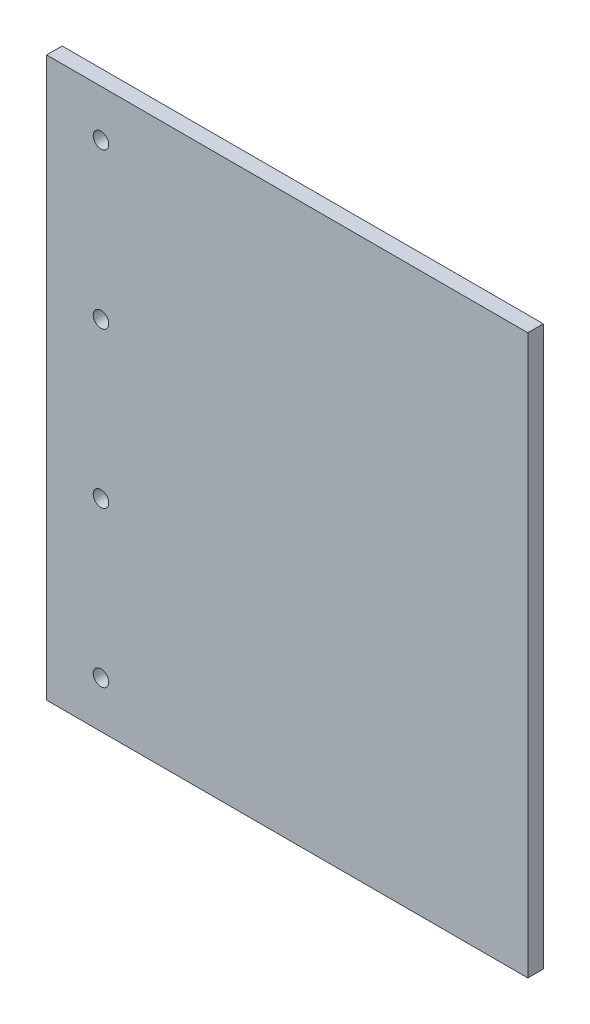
ISO-10303-21;
HEADER;
FILE_DESCRIPTION(('STEP AP214'),'2;1');
FILE_NAME('part.step','',(''),(''),'','','');
FILE_SCHEMA(('AUTOMOTIVE_DESIGN { 1 0 10303 214 1 1 1 1 }'));
ENDSEC;
DATA;
#1=APPLICATION_CONTEXT('core data for automotive mechanical design processes');
#2=APPLICATION_PROTOCOL_DEFINITION('international standard','automotive_design',2000,#1);
#3=PRODUCT_CONTEXT('',#1,'mechanical');
#4=PRODUCT('Part','Part','',(#3));
#5=PRODUCT_RELATED_PRODUCT_CATEGORY('part','',(#4));
#6=PRODUCT_DEFINITION_FORMATION('','',#4);
#7=PRODUCT_DEFINITION_CONTEXT('part definition',#1,'design');
#8=PRODUCT_DEFINITION('design','',#6,#7);
#9=PRODUCT_DEFINITION_SHAPE('','',#8);
#10=(LENGTH_UNIT() NAMED_UNIT(*) SI_UNIT(.MILLI.,.METRE.));
#11=(NAMED_UNIT(*) PLANE_ANGLE_UNIT() SI_UNIT($,.RADIAN.));
#12=(NAMED_UNIT(*) SI_UNIT($,.STERADIAN.) SOLID_ANGLE_UNIT());
#13=UNCERTAINTY_MEASURE_WITH_UNIT(LENGTH_MEASURE(1.E-05),#10,'distance_accuracy_value','');
#14=(GEOMETRIC_REPRESENTATION_CONTEXT(3) GLOBAL_UNCERTAINTY_ASSIGNED_CONTEXT((#13)) GLOBAL_UNIT_ASSIGNED_CONTEXT((#10,
#11,#12)) REPRESENTATION_CONTEXT('',''));
#15=CARTESIAN_POINT('',(0.,0.,0.));
#16=DIRECTION('',(0.,0.,1.));
#17=DIRECTION('',(1.,0.,0.));
#18=AXIS2_PLACEMENT_3D('',#15,#16,#17);
#19=CARTESIAN_POINT('',(0.,0.,12.7));
#20=DIRECTION('',(1.,0.,0.));
#21=DIRECTION('',(0.,0.,-1.));
#22=AXIS2_PLACEMENT_3D('',#19,#20,#21);
#23=PLANE('',#22);
#24=DIRECTION('',(0.,-1.,0.));
#25=VECTOR('',#24,1.);
#26=CARTESIAN_POINT('',(0.,0.,0.));
#27=LINE('',#26,#25);
#28=CARTESIAN_POINT('',(0.,457.2,0.));
#29=VERTEX_POINT('',#28);
#30=CARTESIAN_POINT('',(0.,0.,0.));
#31=VERTEX_POINT('',#30);
#32=EDGE_CURVE('E109',#29,#31,#27,.T.);
#33=ORIENTED_EDGE('',*,*,#32,.T.);
#34=DIRECTION('',(0.,0.,-1.));
#35=VECTOR('',#34,1.);
#36=CARTESIAN_POINT('',(0.,0.,12.7));
#37=LINE('',#36,#35);
#38=CARTESIAN_POINT('',(0.,0.,12.7));
#39=VERTEX_POINT('',#38);
#40=EDGE_CURVE('E101',#39,#31,#37,.T.);
#41=ORIENTED_EDGE('',*,*,#40,.F.);
#42=DIRECTION('',(0.,-1.,0.));
#43=VECTOR('',#42,1.);
#44=CARTESIAN_POINT('',(0.,0.,12.7));
#45=LINE('',#44,#43);
#46=CARTESIAN_POINT('',(0.,457.2,12.7));
#47=VERTEX_POINT('',#46);
#48=EDGE_CURVE('E92',#47,#39,#45,.T.);
#49=ORIENTED_EDGE('',*,*,#48,.F.);
#50=DIRECTION('',(0.,0.,-1.));
#51=VECTOR('',#50,1.);
#52=CARTESIAN_POINT('',(0.,457.2,12.7));
#53=LINE('',#52,#51);
#54=EDGE_CURVE('E106',#47,#29,#53,.T.);
#55=ORIENTED_EDGE('',*,*,#54,.T.);
#56=EDGE_LOOP('',(#33,#41,#49,#55));
#57=FACE_BOUND('',#56,.T.);
#58=ADVANCED_FACE('F41',(#57),#23,.F.);
#59=CARTESIAN_POINT('',(0.,0.,12.7));
#60=DIRECTION('',(0.,1.,0.));
#61=DIRECTION('',(0.,0.,1.));
#62=AXIS2_PLACEMENT_3D('',#59,#60,#61);
#63=PLANE('',#62);
#64=DIRECTION('',(1.,0.,0.));
#65=VECTOR('',#64,1.);
#66=CARTESIAN_POINT('',(0.,0.,0.));
#67=LINE('',#66,#65);
#68=CARTESIAN_POINT('',(393.7,0.,0.));
#69=VERTEX_POINT('',#68);
#70=EDGE_CURVE('E99',#31,#69,#67,.T.);
#71=ORIENTED_EDGE('',*,*,#70,.T.);
#72=DIRECTION('',(0.,0.,-1.));
#73=VECTOR('',#72,1.);
#74=CARTESIAN_POINT('',(393.7,0.,12.7));
#75=LINE('',#74,#73);
#76=CARTESIAN_POINT('',(393.7,0.,12.7));
#77=VERTEX_POINT('',#76);
#78=EDGE_CURVE('E98',#77,#69,#75,.T.);
#79=ORIENTED_EDGE('',*,*,#78,.F.);
#80=DIRECTION('',(1.,0.,0.));
#81=VECTOR('',#80,1.);
#82=CARTESIAN_POINT('',(0.,0.,12.7));
#83=LINE('',#82,#81);
#84=EDGE_CURVE('E90',#39,#77,#83,.T.);
#85=ORIENTED_EDGE('',*,*,#84,.F.);
#86=ORIENTED_EDGE('',*,*,#40,.T.);
#87=EDGE_LOOP('',(#71,#79,#85,#86));
#88=FACE_BOUND('',#87,.T.);
#89=ADVANCED_FACE('F97',(#88),#63,.F.);
#90=CARTESIAN_POINT('',(393.7,0.,12.7));
#91=DIRECTION('',(-1.,0.,0.));
#92=DIRECTION('',(0.,0.,1.));
#93=AXIS2_PLACEMENT_3D('',#90,#91,#92);
#94=PLANE('',#93);
#95=DIRECTION('',(0.,1.,0.));
#96=VECTOR('',#95,1.);
#97=CARTESIAN_POINT('',(393.7,0.,0.));
#98=LINE('',#97,#96);
#99=CARTESIAN_POINT('',(393.7,457.2,0.));
#100=VERTEX_POINT('',#99);
#101=EDGE_CURVE('E73',#69,#100,#98,.T.);
#102=ORIENTED_EDGE('',*,*,#101,.T.);
#103=DIRECTION('',(0.,0.,-1.));
#104=VECTOR('',#103,1.);
#105=CARTESIAN_POINT('',(393.7,457.2,12.7));
#106=LINE('',#105,#104);
#107=CARTESIAN_POINT('',(393.7,457.2,12.7));
#108=VERTEX_POINT('',#107);
#109=EDGE_CURVE('E105',#108,#100,#106,.T.);
#110=ORIENTED_EDGE('',*,*,#109,.F.);
#111=DIRECTION('',(0.,1.,0.));
#112=VECTOR('',#111,1.);
#113=CARTESIAN_POINT('',(393.7,0.,12.7));
#114=LINE('',#113,#112);
#115=EDGE_CURVE('E91',#77,#108,#114,.T.);
#116=ORIENTED_EDGE('',*,*,#115,.F.);
#117=ORIENTED_EDGE('',*,*,#78,.T.);
#118=EDGE_LOOP('',(#102,#110,#116,#117));
#119=FACE_BOUND('',#118,.T.);
#120=ADVANCED_FACE('F102',(#119),#94,.F.);
#121=CARTESIAN_POINT('',(0.,457.2,12.7));
#122=DIRECTION('',(0.,-1.,0.));
#123=DIRECTION('',(0.,0.,-1.));
#124=AXIS2_PLACEMENT_3D('',#121,#122,#123);
#125=PLANE('',#124);
#126=DIRECTION('',(-1.,0.,0.));
#127=VECTOR('',#126,1.);
#128=CARTESIAN_POINT('',(0.,457.2,0.));
#129=LINE('',#128,#127);
#130=EDGE_CURVE('E81',#100,#29,#129,.T.);
#131=ORIENTED_EDGE('',*,*,#130,.T.);
#132=ORIENTED_EDGE('',*,*,#54,.F.);
#133=DIRECTION('',(-1.,0.,0.));
#134=VECTOR('',#133,1.);
#135=CARTESIAN_POINT('',(0.,457.2,12.7));
#136=LINE('',#135,#134);
#137=EDGE_CURVE('E59',#108,#47,#136,.T.);
#138=ORIENTED_EDGE('',*,*,#137,.F.);
#139=ORIENTED_EDGE('',*,*,#109,.T.);
#140=EDGE_LOOP('',(#131,#132,#138,#139));
#141=FACE_BOUND('',#140,.T.);
#142=ADVANCED_FACE('F148',(#141),#125,.F.);
#143=CARTESIAN_POINT('',(0.,457.2,12.7));
#144=DIRECTION('',(0.,0.,-1.));
#145=DIRECTION('',(-1.,0.,0.));
#146=AXIS2_PLACEMENT_3D('',#143,#144,#145);
#147=PLANE('',#146);
#148=CARTESIAN_POINT('',(44.45,165.1,12.7));
#149=DIRECTION('',(0.,0.,1.));
#150=DIRECTION('',(1.,0.,0.));
#151=AXIS2_PLACEMENT_3D('',#148,#149,#150);
#152=CIRCLE('',#151,6.34999999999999);
#153=CARTESIAN_POINT('',(50.8,165.1,12.7));
#154=VERTEX_POINT('',#153);
#155=EDGE_CURVE('E182',#154,#154,#152,.T.);
#156=ORIENTED_EDGE('',*,*,#155,.F.);
#157=EDGE_LOOP('',(#156));
#158=FACE_BOUND('',#157,.T.);
#159=CARTESIAN_POINT('',(44.45,38.1,12.7));
#160=DIRECTION('',(0.,0.,1.));
#161=DIRECTION('',(1.,0.,0.));
#162=AXIS2_PLACEMENT_3D('',#159,#160,#161);
#163=CIRCLE('',#162,6.34999999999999);
#164=CARTESIAN_POINT('',(50.8,38.1,12.7));
#165=VERTEX_POINT('',#164);
#166=EDGE_CURVE('E123',#165,#165,#163,.T.);
#167=ORIENTED_EDGE('',*,*,#166,.F.);
#168=EDGE_LOOP('',(#167));
#169=FACE_BOUND('',#168,.T.);
#170=ORIENTED_EDGE('',*,*,#48,.T.);
#171=ORIENTED_EDGE('',*,*,#84,.T.);
#172=ORIENTED_EDGE('',*,*,#115,.T.);
#173=ORIENTED_EDGE('',*,*,#137,.T.);
#174=EDGE_LOOP('',(#170,#171,#172,#173));
#175=FACE_BOUND('',#174,.T.);
#176=CARTESIAN_POINT('',(44.45,292.1,12.7));
#177=DIRECTION('',(0.,0.,1.));
#178=DIRECTION('',(1.,0.,0.));
#179=AXIS2_PLACEMENT_3D('',#176,#177,#178);
#180=CIRCLE('',#179,6.34999999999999);
#181=CARTESIAN_POINT('',(50.8,292.1,12.7));
#182=VERTEX_POINT('',#181);
#183=EDGE_CURVE('E127',#182,#182,#180,.T.);
#184=ORIENTED_EDGE('',*,*,#183,.F.);
#185=EDGE_LOOP('',(#184));
#186=FACE_BOUND('',#185,.T.);
#187=CARTESIAN_POINT('',(44.45,419.1,12.7));
#188=DIRECTION('',(0.,0.,1.));
#189=DIRECTION('',(1.,0.,0.));
#190=AXIS2_PLACEMENT_3D('',#187,#188,#189);
#191=CIRCLE('',#190,6.34999999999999);
#192=CARTESIAN_POINT('',(50.8,419.1,12.7));
#193=VERTEX_POINT('',#192);
#194=EDGE_CURVE('E11',#193,#193,#191,.T.);
#195=ORIENTED_EDGE('',*,*,#194,.F.);
#196=EDGE_LOOP('',(#195));
#197=FACE_BOUND('',#196,.T.);
#198=ADVANCED_FACE('F89',(#158,#169,#175,#186,#197),#147,.F.);
#199=CARTESIAN_POINT('',(0.,457.2,0.));
#200=DIRECTION('',(0.,0.,-1.));
#201=DIRECTION('',(-1.,0.,0.));
#202=AXIS2_PLACEMENT_3D('',#199,#200,#201);
#203=PLANE('',#202);
#204=CARTESIAN_POINT('',(44.45,165.1,0.));
#205=DIRECTION('',(0.,0.,-1.));
#206=DIRECTION('',(-1.,0.,0.));
#207=AXIS2_PLACEMENT_3D('',#204,#205,#206);
#208=CIRCLE('',#207,6.34999999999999);
#209=CARTESIAN_POINT('',(38.1,165.1,0.));
#210=VERTEX_POINT('',#209);
#211=EDGE_CURVE('E178',#210,#210,#208,.T.);
#212=ORIENTED_EDGE('',*,*,#211,.F.);
#213=EDGE_LOOP('',(#212));
#214=FACE_BOUND('',#213,.T.);
#215=CARTESIAN_POINT('',(44.45,38.1,0.));
#216=DIRECTION('',(0.,0.,-1.));
#217=DIRECTION('',(-1.,0.,0.));
#218=AXIS2_PLACEMENT_3D('',#215,#216,#217);
#219=CIRCLE('',#218,6.34999999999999);
#220=CARTESIAN_POINT('',(38.1,38.1,0.));
#221=VERTEX_POINT('',#220);
#222=EDGE_CURVE('E114',#221,#221,#219,.T.);
#223=ORIENTED_EDGE('',*,*,#222,.F.);
#224=EDGE_LOOP('',(#223));
#225=FACE_BOUND('',#224,.T.);
#226=ORIENTED_EDGE('',*,*,#32,.F.);
#227=ORIENTED_EDGE('',*,*,#130,.F.);
#228=ORIENTED_EDGE('',*,*,#101,.F.);
#229=ORIENTED_EDGE('',*,*,#70,.F.);
#230=EDGE_LOOP('',(#226,#227,#228,#229));
#231=FACE_BOUND('',#230,.T.);
#232=CARTESIAN_POINT('',(44.45,292.1,0.));
#233=DIRECTION('',(0.,0.,-1.));
#234=DIRECTION('',(-1.,0.,0.));
#235=AXIS2_PLACEMENT_3D('',#232,#233,#234);
#236=CIRCLE('',#235,6.34999999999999);
#237=CARTESIAN_POINT('',(38.1,292.1,0.));
#238=VERTEX_POINT('',#237);
#239=EDGE_CURVE('E119',#238,#238,#236,.T.);
#240=ORIENTED_EDGE('',*,*,#239,.F.);
#241=EDGE_LOOP('',(#240));
#242=FACE_BOUND('',#241,.T.);
#243=CARTESIAN_POINT('',(44.45,419.1,0.));
#244=DIRECTION('',(0.,0.,-1.));
#245=DIRECTION('',(-1.,0.,0.));
#246=AXIS2_PLACEMENT_3D('',#243,#244,#245);
#247=CIRCLE('',#246,6.34999999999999);
#248=CARTESIAN_POINT('',(38.1,419.1,0.));
#249=VERTEX_POINT('',#248);
#250=EDGE_CURVE('E49',#249,#249,#247,.T.);
#251=ORIENTED_EDGE('',*,*,#250,.F.);
#252=EDGE_LOOP('',(#251));
#253=FACE_BOUND('',#252,.T.);
#254=ADVANCED_FACE('F135',(#214,#225,#231,#242,#253),#203,.T.);
#255=CARTESIAN_POINT('',(44.45,38.1,12.7));
#256=DIRECTION('',(0.,0.,1.));
#257=DIRECTION('',(1.,0.,0.));
#258=AXIS2_PLACEMENT_3D('',#255,#256,#257);
#259=CYLINDRICAL_SURFACE('',#258,6.34999999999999);
#260=ORIENTED_EDGE('',*,*,#222,.T.);
#261=EDGE_LOOP('',(#260));
#262=FACE_BOUND('',#261,.T.);
#263=ORIENTED_EDGE('',*,*,#166,.T.);
#264=EDGE_LOOP('',(#263));
#265=FACE_BOUND('',#264,.T.);
#266=ADVANCED_FACE('F133',(#262,#265),#259,.F.);
#267=CARTESIAN_POINT('',(44.45,165.1,12.7));
#268=DIRECTION('',(0.,0.,1.));
#269=DIRECTION('',(1.,0.,0.));
#270=AXIS2_PLACEMENT_3D('',#267,#268,#269);
#271=CYLINDRICAL_SURFACE('',#270,6.34999999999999);
#272=ORIENTED_EDGE('',*,*,#211,.T.);
#273=EDGE_LOOP('',(#272));
#274=FACE_BOUND('',#273,.T.);
#275=ORIENTED_EDGE('',*,*,#155,.T.);
#276=EDGE_LOOP('',(#275));
#277=FACE_BOUND('',#276,.T.);
#278=ADVANCED_FACE('F141',(#274,#277),#271,.F.);
#279=CARTESIAN_POINT('',(44.45,292.1,12.7));
#280=DIRECTION('',(0.,0.,1.));
#281=DIRECTION('',(1.,0.,0.));
#282=AXIS2_PLACEMENT_3D('',#279,#280,#281);
#283=CYLINDRICAL_SURFACE('',#282,6.34999999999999);
#284=ORIENTED_EDGE('',*,*,#239,.T.);
#285=EDGE_LOOP('',(#284));
#286=FACE_BOUND('',#285,.T.);
#287=ORIENTED_EDGE('',*,*,#183,.T.);
#288=EDGE_LOOP('',(#287));
#289=FACE_BOUND('',#288,.T.);
#290=ADVANCED_FACE('F159',(#286,#289),#283,.F.);
#291=CARTESIAN_POINT('',(44.45,419.1,12.7));
#292=DIRECTION('',(0.,0.,1.));
#293=DIRECTION('',(1.,0.,0.));
#294=AXIS2_PLACEMENT_3D('',#291,#292,#293);
#295=CYLINDRICAL_SURFACE('',#294,6.34999999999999);
#296=ORIENTED_EDGE('',*,*,#250,.T.);
#297=EDGE_LOOP('',(#296));
#298=FACE_BOUND('',#297,.T.);
#299=ORIENTED_EDGE('',*,*,#194,.T.);
#300=EDGE_LOOP('',(#299));
#301=FACE_BOUND('',#300,.T.);
#302=ADVANCED_FACE('F43',(#298,#301),#295,.F.);
#303=CLOSED_SHELL('',(#58,#89,#120,#142,#198,#254,#266,#278,#290,#302));
#304=MANIFOLD_SOLID_BREP('B2',#303);
#305=ADVANCED_BREP_SHAPE_REPRESENTATION('',(#18,#304),#14);
#306=SHAPE_DEFINITION_REPRESENTATION(#9,#305);
ENDSEC;
END-ISO-10303-21;
